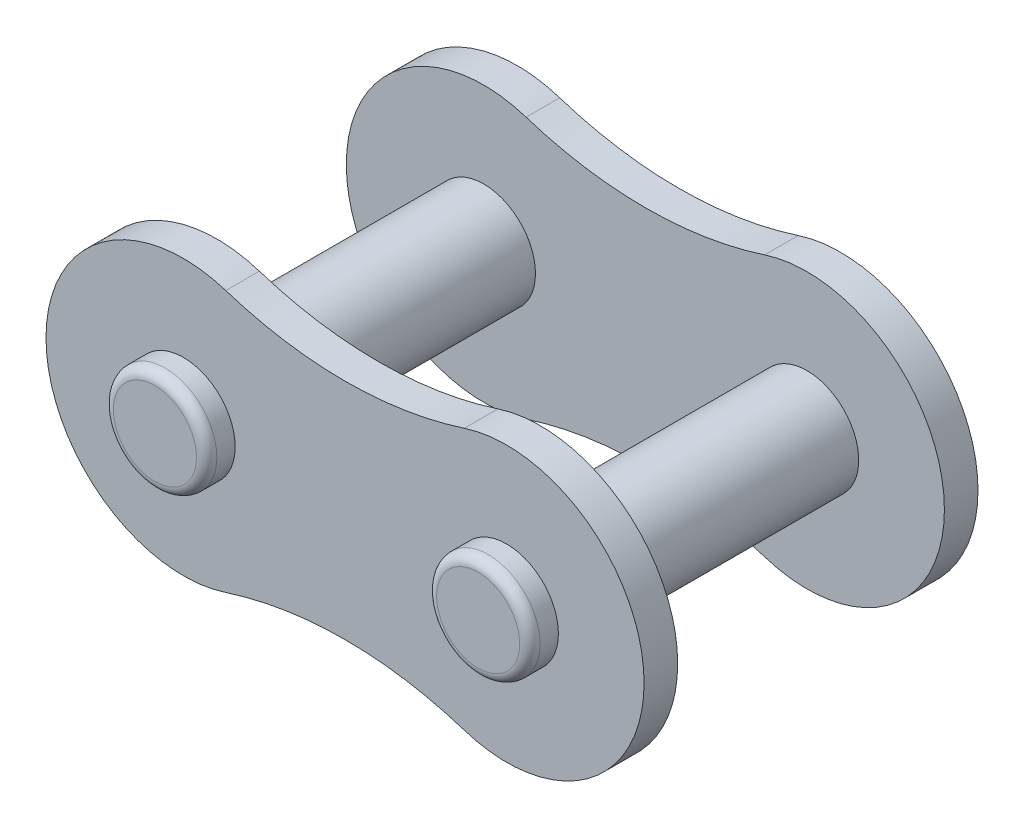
ISO-10303-21;
HEADER;
FILE_DESCRIPTION(('STEP AP214'),'2;1');
FILE_NAME('part.step','',(''),(''),'','','');
FILE_SCHEMA(('AUTOMOTIVE_DESIGN { 1 0 10303 214 1 1 1 1 }'));
ENDSEC;
DATA;
#1=APPLICATION_CONTEXT('core data for automotive mechanical design processes');
#2=APPLICATION_PROTOCOL_DEFINITION('international standard','automotive_design',2000,#1);
#3=PRODUCT_CONTEXT('',#1,'mechanical');
#4=PRODUCT('Part','Part','',(#3));
#5=PRODUCT_RELATED_PRODUCT_CATEGORY('part','',(#4));
#6=PRODUCT_DEFINITION_FORMATION('','',#4);
#7=PRODUCT_DEFINITION_CONTEXT('part definition',#1,'design');
#8=PRODUCT_DEFINITION('design','',#6,#7);
#9=PRODUCT_DEFINITION_SHAPE('','',#8);
#10=(LENGTH_UNIT() NAMED_UNIT(*) SI_UNIT(.MILLI.,.METRE.));
#11=(NAMED_UNIT(*) PLANE_ANGLE_UNIT() SI_UNIT($,.RADIAN.));
#12=(NAMED_UNIT(*) SI_UNIT($,.STERADIAN.) SOLID_ANGLE_UNIT());
#13=UNCERTAINTY_MEASURE_WITH_UNIT(LENGTH_MEASURE(1.E-05),#10,'distance_accuracy_value','');
#14=(GEOMETRIC_REPRESENTATION_CONTEXT(3) GLOBAL_UNCERTAINTY_ASSIGNED_CONTEXT((#13)) GLOBAL_UNIT_ASSIGNED_CONTEXT((#10,
#11,#12)) REPRESENTATION_CONTEXT('',''));
#15=CARTESIAN_POINT('',(0.,0.,0.));
#16=DIRECTION('',(0.,0.,1.));
#17=DIRECTION('',(1.,0.,0.));
#18=AXIS2_PLACEMENT_3D('',#15,#16,#17);
#19=CARTESIAN_POINT('',(0.,0.,-10.56));
#20=DIRECTION('',(0.,0.,-1.));
#21=DIRECTION('',(-1.,0.,0.));
#22=AXIS2_PLACEMENT_3D('',#19,#20,#21);
#23=CYLINDRICAL_SURFACE('',#22,2.54);
#24=CARTESIAN_POINT('',(0.,0.,-6.55));
#25=DIRECTION('',(0.,0.,-1.));
#26=DIRECTION('',(-1.,0.,0.));
#27=AXIS2_PLACEMENT_3D('',#24,#25,#26);
#28=CIRCLE('',#27,2.54);
#29=CARTESIAN_POINT('',(-2.54,0.,-6.55));
#30=VERTEX_POINT('',#29);
#31=EDGE_CURVE('E199',#30,#30,#28,.T.);
#32=ORIENTED_EDGE('',*,*,#31,.F.);
#33=EDGE_LOOP('',(#32));
#34=FACE_BOUND('',#33,.T.);
#35=CARTESIAN_POINT('',(0.,0.,6.55));
#36=DIRECTION('',(0.,0.,1.));
#37=DIRECTION('',(1.,0.,0.));
#38=AXIS2_PLACEMENT_3D('',#35,#36,#37);
#39=CIRCLE('',#38,2.54);
#40=CARTESIAN_POINT('',(2.54,0.,6.55));
#41=VERTEX_POINT('',#40);
#42=EDGE_CURVE('E11',#41,#41,#39,.T.);
#43=ORIENTED_EDGE('',*,*,#42,.F.);
#44=EDGE_LOOP('',(#43));
#45=FACE_BOUND('',#44,.T.);
#46=ADVANCED_FACE('F33',(#34,#45),#23,.T.);
#47=CARTESIAN_POINT('',(-15.875,0.,9.6));
#48=DIRECTION('',(0.,0.,1.));
#49=DIRECTION('',(1.,0.,0.));
#50=AXIS2_PLACEMENT_3D('',#47,#48,#49);
#51=CYLINDRICAL_SURFACE('',#50,2.54);
#52=CARTESIAN_POINT('',(-15.875,0.,-6.55));
#53=DIRECTION('',(0.,0.,-1.));
#54=DIRECTION('',(-1.,0.,0.));
#55=AXIS2_PLACEMENT_3D('',#52,#53,#54);
#56=CIRCLE('',#55,2.54);
#57=CARTESIAN_POINT('',(-18.415,0.,-6.55));
#58=VERTEX_POINT('',#57);
#59=EDGE_CURVE('E157',#58,#58,#56,.T.);
#60=ORIENTED_EDGE('',*,*,#59,.F.);
#61=EDGE_LOOP('',(#60));
#62=FACE_BOUND('',#61,.T.);
#63=CARTESIAN_POINT('',(-15.875,0.,6.55));
#64=DIRECTION('',(0.,0.,1.));
#65=DIRECTION('',(1.,0.,0.));
#66=AXIS2_PLACEMENT_3D('',#63,#64,#65);
#67=CIRCLE('',#66,2.54);
#68=CARTESIAN_POINT('',(-13.335,0.,6.55));
#69=VERTEX_POINT('',#68);
#70=EDGE_CURVE('E136',#69,#69,#67,.F.);
#71=ORIENTED_EDGE('',*,*,#70,.T.);
#72=EDGE_LOOP('',(#71));
#73=FACE_BOUND('',#72,.T.);
#74=ADVANCED_FACE('F204',(#62,#73),#51,.T.);
#75=CARTESIAN_POINT('',(0.,0.,-8.2));
#76=DIRECTION('',(0.,0.,-1.));
#77=DIRECTION('',(-1.,0.,0.));
#78=AXIS2_PLACEMENT_3D('',#75,#76,#77);
#79=CIRCLE('',#78,2.54);
#80=CARTESIAN_POINT('',(-2.54,0.,-8.2));
#81=VERTEX_POINT('',#80);
#82=EDGE_CURVE('E163',#81,#81,#79,.T.);
#83=ORIENTED_EDGE('',*,*,#82,.T.);
#84=EDGE_LOOP('',(#83));
#85=FACE_BOUND('',#84,.T.);
#86=CARTESIAN_POINT('',(0.,0.,-9.1));
#87=DIRECTION('',(0.,0.,-1.));
#88=DIRECTION('',(-1.,0.,0.));
#89=AXIS2_PLACEMENT_3D('',#86,#87,#88);
#90=CIRCLE('',#89,2.54);
#91=CARTESIAN_POINT('',(-2.54,0.,-9.1));
#92=VERTEX_POINT('',#91);
#93=EDGE_CURVE('E193',#92,#92,#90,.T.);
#94=ORIENTED_EDGE('',*,*,#93,.F.);
#95=EDGE_LOOP('',(#94));
#96=FACE_BOUND('',#95,.T.);
#97=ADVANCED_FACE('F214',(#85,#96),#23,.T.);
#98=CARTESIAN_POINT('',(0.,0.,-9.1));
#99=DIRECTION('',(0.,0.,-1.));
#100=DIRECTION('',(-1.,0.,0.));
#101=AXIS2_PLACEMENT_3D('',#98,#99,#100);
#102=TOROIDAL_SURFACE('',#101,2.04,0.500000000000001);
#103=CARTESIAN_POINT('',(0.,0.,-9.6));
#104=DIRECTION('',(0.,0.,-1.));
#105=DIRECTION('',(-1.,0.,0.));
#106=AXIS2_PLACEMENT_3D('',#103,#104,#105);
#107=CIRCLE('',#106,2.04);
#108=CARTESIAN_POINT('',(-2.04,0.,-9.6));
#109=VERTEX_POINT('',#108);
#110=EDGE_CURVE('E190',#109,#109,#107,.T.);
#111=ORIENTED_EDGE('',*,*,#110,.F.);
#112=EDGE_LOOP('',(#111));
#113=FACE_BOUND('',#112,.T.);
#114=ORIENTED_EDGE('',*,*,#93,.T.);
#115=EDGE_LOOP('',(#114));
#116=FACE_BOUND('',#115,.T.);
#117=ADVANCED_FACE('F227',(#113,#116),#102,.T.);
#118=CARTESIAN_POINT('',(0.,0.,-9.6));
#119=DIRECTION('',(0.,0.,1.));
#120=DIRECTION('',(1.,0.,0.));
#121=AXIS2_PLACEMENT_3D('',#118,#119,#120);
#122=PLANE('',#121);
#123=ORIENTED_EDGE('',*,*,#110,.T.);
#124=EDGE_LOOP('',(#123));
#125=FACE_BOUND('',#124,.T.);
#126=ADVANCED_FACE('F232',(#125),#122,.F.);
#127=CARTESIAN_POINT('',(-3.96875,-12.2480467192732,-8.2));
#128=DIRECTION('',(0.,0.,-1.));
#129=DIRECTION('',(-1.,0.,0.));
#130=AXIS2_PLACEMENT_3D('',#127,#128,#129);
#131=PLANE('',#130);
#132=ORIENTED_EDGE('',*,*,#82,.F.);
#133=EDGE_LOOP('',(#132));
#134=FACE_BOUND('',#133,.T.);
#135=CARTESIAN_POINT('',(-7.9375,-24.4960934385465,-8.2));
#136=DIRECTION('',(0.,0.,1.));
#137=DIRECTION('',(-1.,0.,0.));
#138=AXIS2_PLACEMENT_3D('',#135,#136,#137);
#139=CIRCLE('',#138,19.);
#140=CARTESIAN_POINT('',(-2.08070388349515,-6.42130604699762,-8.2));
#141=VERTEX_POINT('',#140);
#142=CARTESIAN_POINT('',(-13.7942961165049,-6.42130604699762,-8.2));
#143=VERTEX_POINT('',#142);
#144=EDGE_CURVE('E167',#141,#143,#139,.T.);
#145=ORIENTED_EDGE('',*,*,#144,.T.);
#146=CARTESIAN_POINT('',(-15.875,0.,-8.2));
#147=DIRECTION('',(0.,0.,-1.));
#148=DIRECTION('',(-1.,0.,0.));
#149=AXIS2_PLACEMENT_3D('',#146,#147,#148);
#150=CIRCLE('',#149,6.75);
#151=CARTESIAN_POINT('',(-13.7942961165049,6.42130604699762,-8.2));
#152=VERTEX_POINT('',#151);
#153=EDGE_CURVE('E83',#143,#152,#150,.T.);
#154=ORIENTED_EDGE('',*,*,#153,.T.);
#155=CARTESIAN_POINT('',(-7.9375,24.4960934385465,-8.2));
#156=DIRECTION('',(0.,0.,1.));
#157=DIRECTION('',(1.,0.,0.));
#158=AXIS2_PLACEMENT_3D('',#155,#156,#157);
#159=CIRCLE('',#158,19.);
#160=CARTESIAN_POINT('',(-2.08070388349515,6.42130604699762,-8.2));
#161=VERTEX_POINT('',#160);
#162=EDGE_CURVE('E170',#152,#161,#159,.T.);
#163=ORIENTED_EDGE('',*,*,#162,.T.);
#164=CARTESIAN_POINT('',(0.,0.,-8.2));
#165=DIRECTION('',(0.,0.,-1.));
#166=DIRECTION('',(-1.,0.,0.));
#167=AXIS2_PLACEMENT_3D('',#164,#165,#166);
#168=CIRCLE('',#167,6.75);
#169=EDGE_CURVE('E51',#161,#141,#168,.T.);
#170=ORIENTED_EDGE('',*,*,#169,.T.);
#171=EDGE_LOOP('',(#145,#154,#163,#170));
#172=FACE_BOUND('',#171,.T.);
#173=CARTESIAN_POINT('',(-15.875,0.,-8.2));
#174=DIRECTION('',(0.,0.,-1.));
#175=DIRECTION('',(-1.,0.,0.));
#176=AXIS2_PLACEMENT_3D('',#173,#174,#175);
#177=CIRCLE('',#176,2.54);
#178=CARTESIAN_POINT('',(-18.415,0.,-8.2));
#179=VERTEX_POINT('',#178);
#180=EDGE_CURVE('E160',#179,#179,#177,.T.);
#181=ORIENTED_EDGE('',*,*,#180,.F.);
#182=EDGE_LOOP('',(#181));
#183=FACE_BOUND('',#182,.T.);
#184=ADVANCED_FACE('F239',(#134,#172,#183),#131,.T.);
#185=CARTESIAN_POINT('',(-3.96875,-12.2480467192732,-6.55));
#186=DIRECTION('',(0.,0.,-1.));
#187=DIRECTION('',(-1.,0.,0.));
#188=AXIS2_PLACEMENT_3D('',#185,#186,#187);
#189=PLANE('',#188);
#190=CARTESIAN_POINT('',(-7.9375,-24.4960934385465,-6.55));
#191=DIRECTION('',(0.,0.,1.));
#192=DIRECTION('',(-1.,0.,0.));
#193=AXIS2_PLACEMENT_3D('',#190,#191,#192);
#194=CIRCLE('',#193,19.);
#195=CARTESIAN_POINT('',(-2.08070388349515,-6.42130604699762,-6.55));
#196=VERTEX_POINT('',#195);
#197=CARTESIAN_POINT('',(-13.7942961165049,-6.42130604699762,-6.55));
#198=VERTEX_POINT('',#197);
#199=EDGE_CURVE('E166',#196,#198,#194,.T.);
#200=ORIENTED_EDGE('',*,*,#199,.F.);
#201=CARTESIAN_POINT('',(0.,0.,-6.55));
#202=DIRECTION('',(0.,0.,-1.));
#203=DIRECTION('',(-1.,0.,0.));
#204=AXIS2_PLACEMENT_3D('',#201,#202,#203);
#205=CIRCLE('',#204,6.75);
#206=CARTESIAN_POINT('',(-2.08070388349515,6.42130604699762,-6.55));
#207=VERTEX_POINT('',#206);
#208=EDGE_CURVE('E75',#207,#196,#205,.T.);
#209=ORIENTED_EDGE('',*,*,#208,.F.);
#210=CARTESIAN_POINT('',(-7.9375,24.4960934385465,-6.55));
#211=DIRECTION('',(0.,0.,1.));
#212=DIRECTION('',(1.,0.,0.));
#213=AXIS2_PLACEMENT_3D('',#210,#211,#212);
#214=CIRCLE('',#213,19.);
#215=CARTESIAN_POINT('',(-13.7942961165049,6.42130604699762,-6.55));
#216=VERTEX_POINT('',#215);
#217=EDGE_CURVE('E69',#216,#207,#214,.T.);
#218=ORIENTED_EDGE('',*,*,#217,.F.);
#219=CARTESIAN_POINT('',(-15.875,0.,-6.55));
#220=DIRECTION('',(0.,0.,-1.));
#221=DIRECTION('',(-1.,0.,0.));
#222=AXIS2_PLACEMENT_3D('',#219,#220,#221);
#223=CIRCLE('',#222,6.75);
#224=EDGE_CURVE('E176',#198,#216,#223,.T.);
#225=ORIENTED_EDGE('',*,*,#224,.F.);
#226=EDGE_LOOP('',(#200,#209,#218,#225));
#227=FACE_BOUND('',#226,.T.);
#228=ORIENTED_EDGE('',*,*,#31,.T.);
#229=EDGE_LOOP('',(#228));
#230=FACE_BOUND('',#229,.T.);
#231=ORIENTED_EDGE('',*,*,#59,.T.);
#232=EDGE_LOOP('',(#231));
#233=FACE_BOUND('',#232,.T.);
#234=ADVANCED_FACE('F241',(#227,#230,#233),#189,.F.);
#235=CARTESIAN_POINT('',(-7.9375,-24.4960934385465,-8.2));
#236=DIRECTION('',(0.,0.,1.));
#237=DIRECTION('',(1.,0.,0.));
#238=AXIS2_PLACEMENT_3D('',#235,#236,#237);
#239=CYLINDRICAL_SURFACE('',#238,19.);
#240=ORIENTED_EDGE('',*,*,#199,.T.);
#241=DIRECTION('',(0.,0.,1.));
#242=VECTOR('',#241,1.);
#243=CARTESIAN_POINT('',(-13.7942961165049,-6.42130604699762,-8.2));
#244=LINE('',#243,#242);
#245=EDGE_CURVE('E185',#143,#198,#244,.T.);
#246=ORIENTED_EDGE('',*,*,#245,.F.);
#247=ORIENTED_EDGE('',*,*,#144,.F.);
#248=DIRECTION('',(0.,0.,1.));
#249=VECTOR('',#248,1.);
#250=CARTESIAN_POINT('',(-2.08070388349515,-6.42130604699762,-8.2));
#251=LINE('',#250,#249);
#252=EDGE_CURVE('E173',#141,#196,#251,.T.);
#253=ORIENTED_EDGE('',*,*,#252,.T.);
#254=EDGE_LOOP('',(#240,#246,#247,#253));
#255=FACE_BOUND('',#254,.T.);
#256=ADVANCED_FACE('F275',(#255),#239,.F.);
#257=CARTESIAN_POINT('',(-15.875,0.,-8.2));
#258=DIRECTION('',(0.,0.,1.));
#259=DIRECTION('',(1.,0.,0.));
#260=AXIS2_PLACEMENT_3D('',#257,#258,#259);
#261=CYLINDRICAL_SURFACE('',#260,6.75);
#262=ORIENTED_EDGE('',*,*,#224,.T.);
#263=DIRECTION('',(0.,0.,1.));
#264=VECTOR('',#263,1.);
#265=CARTESIAN_POINT('',(-13.7942961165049,6.42130604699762,-8.2));
#266=LINE('',#265,#264);
#267=EDGE_CURVE('E183',#152,#216,#266,.T.);
#268=ORIENTED_EDGE('',*,*,#267,.F.);
#269=ORIENTED_EDGE('',*,*,#153,.F.);
#270=ORIENTED_EDGE('',*,*,#245,.T.);
#271=EDGE_LOOP('',(#262,#268,#269,#270));
#272=FACE_BOUND('',#271,.T.);
#273=ADVANCED_FACE('F282',(#272),#261,.T.);
#274=CARTESIAN_POINT('',(-7.9375,24.4960934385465,-8.2));
#275=DIRECTION('',(0.,0.,1.));
#276=DIRECTION('',(1.,0.,0.));
#277=AXIS2_PLACEMENT_3D('',#274,#275,#276);
#278=CYLINDRICAL_SURFACE('',#277,19.);
#279=ORIENTED_EDGE('',*,*,#217,.T.);
#280=DIRECTION('',(0.,0.,1.));
#281=VECTOR('',#280,1.);
#282=CARTESIAN_POINT('',(-2.08070388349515,6.42130604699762,-8.2));
#283=LINE('',#282,#281);
#284=EDGE_CURVE('E181',#161,#207,#283,.T.);
#285=ORIENTED_EDGE('',*,*,#284,.F.);
#286=ORIENTED_EDGE('',*,*,#162,.F.);
#287=ORIENTED_EDGE('',*,*,#267,.T.);
#288=EDGE_LOOP('',(#279,#285,#286,#287));
#289=FACE_BOUND('',#288,.T.);
#290=ADVANCED_FACE('F279',(#289),#278,.F.);
#291=CARTESIAN_POINT('',(0.,0.,-8.2));
#292=DIRECTION('',(0.,0.,1.));
#293=DIRECTION('',(1.,0.,0.));
#294=AXIS2_PLACEMENT_3D('',#291,#292,#293);
#295=CYLINDRICAL_SURFACE('',#294,6.75);
#296=ORIENTED_EDGE('',*,*,#208,.T.);
#297=ORIENTED_EDGE('',*,*,#252,.F.);
#298=ORIENTED_EDGE('',*,*,#169,.F.);
#299=ORIENTED_EDGE('',*,*,#284,.T.);
#300=EDGE_LOOP('',(#296,#297,#298,#299));
#301=FACE_BOUND('',#300,.T.);
#302=ADVANCED_FACE('F260',(#301),#295,.T.);
#303=CARTESIAN_POINT('',(-17.915,0.,-9.6));
#304=DIRECTION('',(0.,0.,-1.));
#305=DIRECTION('',(-1.,0.,0.));
#306=AXIS2_PLACEMENT_3D('',#303,#304,#305);
#307=PLANE('',#306);
#308=CARTESIAN_POINT('',(-15.875,0.,-9.6));
#309=DIRECTION('',(0.,0.,1.));
#310=DIRECTION('',(1.,0.,0.));
#311=AXIS2_PLACEMENT_3D('',#308,#309,#310);
#312=CIRCLE('',#311,2.04);
#313=CARTESIAN_POINT('',(-13.835,0.,-9.6));
#314=VERTEX_POINT('',#313);
#315=EDGE_CURVE('E151',#314,#314,#312,.T.);
#316=ORIENTED_EDGE('',*,*,#315,.F.);
#317=EDGE_LOOP('',(#316));
#318=FACE_BOUND('',#317,.T.);
#319=ADVANCED_FACE('F254',(#318),#307,.T.);
#320=CARTESIAN_POINT('',(-15.875,0.,-9.1));
#321=DIRECTION('',(0.,0.,1.));
#322=DIRECTION('',(1.,0.,0.));
#323=AXIS2_PLACEMENT_3D('',#320,#321,#322);
#324=TOROIDAL_SURFACE('',#323,2.04,0.500000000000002);
#325=ORIENTED_EDGE('',*,*,#315,.T.);
#326=EDGE_LOOP('',(#325));
#327=FACE_BOUND('',#326,.T.);
#328=CARTESIAN_POINT('',(-15.875,0.,-9.1));
#329=DIRECTION('',(0.,0.,1.));
#330=DIRECTION('',(1.,0.,0.));
#331=AXIS2_PLACEMENT_3D('',#328,#329,#330);
#332=CIRCLE('',#331,2.54);
#333=CARTESIAN_POINT('',(-13.335,0.,-9.1));
#334=VERTEX_POINT('',#333);
#335=EDGE_CURVE('E148',#334,#334,#332,.T.);
#336=ORIENTED_EDGE('',*,*,#335,.F.);
#337=EDGE_LOOP('',(#336));
#338=FACE_BOUND('',#337,.T.);
#339=ADVANCED_FACE('F250',(#327,#338),#324,.T.);
#340=ORIENTED_EDGE('',*,*,#180,.T.);
#341=EDGE_LOOP('',(#340));
#342=FACE_BOUND('',#341,.T.);
#343=ORIENTED_EDGE('',*,*,#335,.T.);
#344=EDGE_LOOP('',(#343));
#345=FACE_BOUND('',#344,.T.);
#346=ADVANCED_FACE('F221',(#342,#345),#51,.T.);
#347=CARTESIAN_POINT('',(-3.96875,-12.2480467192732,8.2));
#348=DIRECTION('',(0.,0.,1.));
#349=DIRECTION('',(-1.,0.,0.));
#350=AXIS2_PLACEMENT_3D('',#347,#348,#349);
#351=PLANE('',#350);
#352=CARTESIAN_POINT('',(-15.875,0.,8.2));
#353=DIRECTION('',(0.,0.,1.));
#354=DIRECTION('',(1.,0.,0.));
#355=AXIS2_PLACEMENT_3D('',#352,#353,#354);
#356=CIRCLE('',#355,2.54);
#357=CARTESIAN_POINT('',(-13.335,0.,8.2));
#358=VERTEX_POINT('',#357);
#359=EDGE_CURVE('E37',#358,#358,#356,.F.);
#360=ORIENTED_EDGE('',*,*,#359,.T.);
#361=EDGE_LOOP('',(#360));
#362=FACE_BOUND('',#361,.T.);
#363=CARTESIAN_POINT('',(-7.9375,-24.4960934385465,8.2));
#364=DIRECTION('',(0.,0.,1.));
#365=DIRECTION('',(-1.,0.,0.));
#366=AXIS2_PLACEMENT_3D('',#363,#364,#365);
#367=CIRCLE('',#366,19.);
#368=CARTESIAN_POINT('',(-2.08070388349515,-6.42130604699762,8.2));
#369=VERTEX_POINT('',#368);
#370=CARTESIAN_POINT('',(-13.7942961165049,-6.42130604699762,8.2));
#371=VERTEX_POINT('',#370);
#372=EDGE_CURVE('E134',#369,#371,#367,.T.);
#373=ORIENTED_EDGE('',*,*,#372,.F.);
#374=CARTESIAN_POINT('',(0.,0.,8.2));
#375=DIRECTION('',(0.,0.,-1.));
#376=DIRECTION('',(-1.,0.,0.));
#377=AXIS2_PLACEMENT_3D('',#374,#375,#376);
#378=CIRCLE('',#377,6.75);
#379=CARTESIAN_POINT('',(-2.08070388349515,6.42130604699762,8.2));
#380=VERTEX_POINT('',#379);
#381=EDGE_CURVE('E116',#380,#369,#378,.T.);
#382=ORIENTED_EDGE('',*,*,#381,.F.);
#383=CARTESIAN_POINT('',(-7.9375,24.4960934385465,8.2));
#384=DIRECTION('',(0.,0.,1.));
#385=DIRECTION('',(1.,0.,0.));
#386=AXIS2_PLACEMENT_3D('',#383,#384,#385);
#387=CIRCLE('',#386,19.);
#388=CARTESIAN_POINT('',(-13.7942961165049,6.42130604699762,8.2));
#389=VERTEX_POINT('',#388);
#390=EDGE_CURVE('E468',#389,#380,#387,.T.);
#391=ORIENTED_EDGE('',*,*,#390,.F.);
#392=CARTESIAN_POINT('',(-15.875,0.,8.2));
#393=DIRECTION('',(0.,0.,-1.));
#394=DIRECTION('',(-1.,0.,0.));
#395=AXIS2_PLACEMENT_3D('',#392,#393,#394);
#396=CIRCLE('',#395,6.75);
#397=EDGE_CURVE('E138',#371,#389,#396,.T.);
#398=ORIENTED_EDGE('',*,*,#397,.F.);
#399=EDGE_LOOP('',(#373,#382,#391,#398));
#400=FACE_BOUND('',#399,.T.);
#401=CARTESIAN_POINT('',(0.,0.,8.2));
#402=DIRECTION('',(0.,0.,1.));
#403=DIRECTION('',(1.,0.,0.));
#404=AXIS2_PLACEMENT_3D('',#401,#402,#403);
#405=CIRCLE('',#404,2.54);
#406=CARTESIAN_POINT('',(2.54,0.,8.2));
#407=VERTEX_POINT('',#406);
#408=EDGE_CURVE('E142',#407,#407,#405,.T.);
#409=ORIENTED_EDGE('',*,*,#408,.F.);
#410=EDGE_LOOP('',(#409));
#411=FACE_BOUND('',#410,.T.);
#412=ADVANCED_FACE('F207',(#362,#400,#411),#351,.T.);
#413=CARTESIAN_POINT('',(-3.96875,-12.2480467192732,6.55));
#414=DIRECTION('',(0.,0.,1.));
#415=DIRECTION('',(-1.,0.,0.));
#416=AXIS2_PLACEMENT_3D('',#413,#414,#415);
#417=PLANE('',#416);
#418=CARTESIAN_POINT('',(-7.9375,-24.4960934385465,6.55));
#419=DIRECTION('',(0.,0.,1.));
#420=DIRECTION('',(-1.,0.,0.));
#421=AXIS2_PLACEMENT_3D('',#418,#419,#420);
#422=CIRCLE('',#421,19.);
#423=CARTESIAN_POINT('',(-2.08070388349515,-6.42130604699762,6.55));
#424=VERTEX_POINT('',#423);
#425=CARTESIAN_POINT('',(-13.7942961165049,-6.42130604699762,6.55));
#426=VERTEX_POINT('',#425);
#427=EDGE_CURVE('E127',#424,#426,#422,.T.);
#428=ORIENTED_EDGE('',*,*,#427,.T.);
#429=CARTESIAN_POINT('',(-15.875,0.,6.55));
#430=DIRECTION('',(0.,0.,-1.));
#431=DIRECTION('',(-1.,0.,0.));
#432=AXIS2_PLACEMENT_3D('',#429,#430,#431);
#433=CIRCLE('',#432,6.75);
#434=CARTESIAN_POINT('',(-13.7942961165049,6.42130604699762,6.55));
#435=VERTEX_POINT('',#434);
#436=EDGE_CURVE('E469',#426,#435,#433,.T.);
#437=ORIENTED_EDGE('',*,*,#436,.T.);
#438=CARTESIAN_POINT('',(-7.9375,24.4960934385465,6.55));
#439=DIRECTION('',(0.,0.,1.));
#440=DIRECTION('',(1.,0.,0.));
#441=AXIS2_PLACEMENT_3D('',#438,#439,#440);
#442=CIRCLE('',#441,19.);
#443=CARTESIAN_POINT('',(-2.08070388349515,6.42130604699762,6.55));
#444=VERTEX_POINT('',#443);
#445=EDGE_CURVE('E129',#435,#444,#442,.T.);
#446=ORIENTED_EDGE('',*,*,#445,.T.);
#447=CARTESIAN_POINT('',(0.,0.,6.55));
#448=DIRECTION('',(0.,0.,-1.));
#449=DIRECTION('',(-1.,0.,0.));
#450=AXIS2_PLACEMENT_3D('',#447,#448,#449);
#451=CIRCLE('',#450,6.75);
#452=EDGE_CURVE('E113',#444,#424,#451,.T.);
#453=ORIENTED_EDGE('',*,*,#452,.T.);
#454=EDGE_LOOP('',(#428,#437,#446,#453));
#455=FACE_BOUND('',#454,.T.);
#456=ORIENTED_EDGE('',*,*,#70,.F.);
#457=EDGE_LOOP('',(#456));
#458=FACE_BOUND('',#457,.T.);
#459=ORIENTED_EDGE('',*,*,#42,.T.);
#460=EDGE_LOOP('',(#459));
#461=FACE_BOUND('',#460,.T.);
#462=ADVANCED_FACE('F124',(#455,#458,#461),#417,.F.);
#463=CARTESIAN_POINT('',(-7.9375,-24.4960934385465,8.2));
#464=DIRECTION('',(0.,0.,-1.));
#465=DIRECTION('',(1.,0.,0.));
#466=AXIS2_PLACEMENT_3D('',#463,#464,#465);
#467=CYLINDRICAL_SURFACE('',#466,19.);
#468=ORIENTED_EDGE('',*,*,#427,.F.);
#469=DIRECTION('',(0.,0.,-1.));
#470=VECTOR('',#469,1.);
#471=CARTESIAN_POINT('',(-2.08070388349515,-6.42130604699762,8.2));
#472=LINE('',#471,#470);
#473=EDGE_CURVE('E110',#369,#424,#472,.T.);
#474=ORIENTED_EDGE('',*,*,#473,.F.);
#475=ORIENTED_EDGE('',*,*,#372,.T.);
#476=DIRECTION('',(0.,0.,-1.));
#477=VECTOR('',#476,1.);
#478=CARTESIAN_POINT('',(-13.7942961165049,-6.42130604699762,8.2));
#479=LINE('',#478,#477);
#480=EDGE_CURVE('E132',#371,#426,#479,.T.);
#481=ORIENTED_EDGE('',*,*,#480,.T.);
#482=EDGE_LOOP('',(#468,#474,#475,#481));
#483=FACE_BOUND('',#482,.T.);
#484=ADVANCED_FACE('F131',(#483),#467,.F.);
#485=CARTESIAN_POINT('',(-15.875,0.,8.2));
#486=DIRECTION('',(0.,0.,-1.));
#487=DIRECTION('',(1.,0.,0.));
#488=AXIS2_PLACEMENT_3D('',#485,#486,#487);
#489=CYLINDRICAL_SURFACE('',#488,6.75);
#490=ORIENTED_EDGE('',*,*,#436,.F.);
#491=ORIENTED_EDGE('',*,*,#480,.F.);
#492=ORIENTED_EDGE('',*,*,#397,.T.);
#493=DIRECTION('',(0.,0.,-1.));
#494=VECTOR('',#493,1.);
#495=CARTESIAN_POINT('',(-13.7942961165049,6.42130604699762,8.2));
#496=LINE('',#495,#494);
#497=EDGE_CURVE('E470',#389,#435,#496,.T.);
#498=ORIENTED_EDGE('',*,*,#497,.T.);
#499=EDGE_LOOP('',(#490,#491,#492,#498));
#500=FACE_BOUND('',#499,.T.);
#501=ADVANCED_FACE('F376',(#500),#489,.T.);
#502=CARTESIAN_POINT('',(-7.9375,24.4960934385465,8.2));
#503=DIRECTION('',(0.,0.,-1.));
#504=DIRECTION('',(1.,0.,0.));
#505=AXIS2_PLACEMENT_3D('',#502,#503,#504);
#506=CYLINDRICAL_SURFACE('',#505,19.);
#507=ORIENTED_EDGE('',*,*,#445,.F.);
#508=ORIENTED_EDGE('',*,*,#497,.F.);
#509=ORIENTED_EDGE('',*,*,#390,.T.);
#510=DIRECTION('',(0.,0.,-1.));
#511=VECTOR('',#510,1.);
#512=CARTESIAN_POINT('',(-2.08070388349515,6.42130604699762,8.2));
#513=LINE('',#512,#511);
#514=EDGE_CURVE('E476',#380,#444,#513,.T.);
#515=ORIENTED_EDGE('',*,*,#514,.T.);
#516=EDGE_LOOP('',(#507,#508,#509,#515));
#517=FACE_BOUND('',#516,.T.);
#518=ADVANCED_FACE('F385',(#517),#506,.F.);
#519=CARTESIAN_POINT('',(0.,0.,8.2));
#520=DIRECTION('',(0.,0.,-1.));
#521=DIRECTION('',(1.,0.,0.));
#522=AXIS2_PLACEMENT_3D('',#519,#520,#521);
#523=CYLINDRICAL_SURFACE('',#522,6.75);
#524=ORIENTED_EDGE('',*,*,#452,.F.);
#525=ORIENTED_EDGE('',*,*,#514,.F.);
#526=ORIENTED_EDGE('',*,*,#381,.T.);
#527=ORIENTED_EDGE('',*,*,#473,.T.);
#528=EDGE_LOOP('',(#524,#525,#526,#527));
#529=FACE_BOUND('',#528,.T.);
#530=ADVANCED_FACE('F112',(#529),#523,.T.);
#531=CARTESIAN_POINT('',(-15.875,0.,9.6));
#532=DIRECTION('',(0.,0.,1.));
#533=DIRECTION('',(1.,0.,0.));
#534=AXIS2_PLACEMENT_3D('',#531,#532,#533);
#535=PLANE('',#534);
#536=CARTESIAN_POINT('',(-15.875,0.,9.6));
#537=DIRECTION('',(0.,0.,1.));
#538=DIRECTION('',(1.,0.,0.));
#539=AXIS2_PLACEMENT_3D('',#536,#537,#538);
#540=CIRCLE('',#539,2.04);
#541=CARTESIAN_POINT('',(-13.835,0.,9.6));
#542=VERTEX_POINT('',#541);
#543=EDGE_CURVE('E154',#542,#542,#540,.T.);
#544=ORIENTED_EDGE('',*,*,#543,.T.);
#545=EDGE_LOOP('',(#544));
#546=FACE_BOUND('',#545,.T.);
#547=ADVANCED_FACE('F265',(#546),#535,.T.);
#548=CARTESIAN_POINT('',(-15.875,0.,9.1));
#549=DIRECTION('',(0.,0.,1.));
#550=DIRECTION('',(1.,0.,0.));
#551=AXIS2_PLACEMENT_3D('',#548,#549,#550);
#552=TOROIDAL_SURFACE('',#551,2.04,0.5);
#553=CARTESIAN_POINT('',(-15.875,0.,9.1));
#554=DIRECTION('',(0.,0.,1.));
#555=DIRECTION('',(1.,0.,0.));
#556=AXIS2_PLACEMENT_3D('',#553,#554,#555);
#557=CIRCLE('',#556,2.54);
#558=CARTESIAN_POINT('',(-13.335,0.,9.1));
#559=VERTEX_POINT('',#558);
#560=EDGE_CURVE('E145',#559,#559,#557,.T.);
#561=ORIENTED_EDGE('',*,*,#560,.T.);
#562=EDGE_LOOP('',(#561));
#563=FACE_BOUND('',#562,.T.);
#564=ORIENTED_EDGE('',*,*,#543,.F.);
#565=EDGE_LOOP('',(#564));
#566=FACE_BOUND('',#565,.T.);
#567=ADVANCED_FACE('F268',(#563,#566),#552,.T.);
#568=ORIENTED_EDGE('',*,*,#359,.F.);
#569=EDGE_LOOP('',(#568));
#570=FACE_BOUND('',#569,.T.);
#571=ORIENTED_EDGE('',*,*,#560,.F.);
#572=EDGE_LOOP('',(#571));
#573=FACE_BOUND('',#572,.T.);
#574=ADVANCED_FACE('F220',(#570,#573),#51,.T.);
#575=CARTESIAN_POINT('',(2.04,0.,9.6));
#576=DIRECTION('',(0.,0.,-1.));
#577=DIRECTION('',(-1.,0.,0.));
#578=AXIS2_PLACEMENT_3D('',#575,#576,#577);
#579=PLANE('',#578);
#580=CARTESIAN_POINT('',(0.,0.,9.6));
#581=DIRECTION('',(0.,0.,-1.));
#582=DIRECTION('',(-1.,0.,0.));
#583=AXIS2_PLACEMENT_3D('',#580,#581,#582);
#584=CIRCLE('',#583,2.04);
#585=CARTESIAN_POINT('',(-2.04,0.,9.6));
#586=VERTEX_POINT('',#585);
#587=EDGE_CURVE('E187',#586,#586,#584,.T.);
#588=ORIENTED_EDGE('',*,*,#587,.F.);
#589=EDGE_LOOP('',(#588));
#590=FACE_BOUND('',#589,.T.);
#591=ADVANCED_FACE('F288',(#590),#579,.F.);
#592=CARTESIAN_POINT('',(0.,0.,9.1));
#593=DIRECTION('',(0.,0.,-1.));
#594=DIRECTION('',(-1.,0.,0.));
#595=AXIS2_PLACEMENT_3D('',#592,#593,#594);
#596=TOROIDAL_SURFACE('',#595,2.04,0.5);
#597=CARTESIAN_POINT('',(0.,0.,9.1));
#598=DIRECTION('',(0.,0.,-1.));
#599=DIRECTION('',(-1.,0.,0.));
#600=AXIS2_PLACEMENT_3D('',#597,#598,#599);
#601=CIRCLE('',#600,2.54);
#602=CARTESIAN_POINT('',(-2.54,0.,9.1));
#603=VERTEX_POINT('',#602);
#604=EDGE_CURVE('E196',#603,#603,#601,.T.);
#605=ORIENTED_EDGE('',*,*,#604,.F.);
#606=EDGE_LOOP('',(#605));
#607=FACE_BOUND('',#606,.T.);
#608=ORIENTED_EDGE('',*,*,#587,.T.);
#609=EDGE_LOOP('',(#608));
#610=FACE_BOUND('',#609,.T.);
#611=ADVANCED_FACE('F35',(#607,#610),#596,.T.);
#612=ORIENTED_EDGE('',*,*,#408,.T.);
#613=EDGE_LOOP('',(#612));
#614=FACE_BOUND('',#613,.T.);
#615=ORIENTED_EDGE('',*,*,#604,.T.);
#616=EDGE_LOOP('',(#615));
#617=FACE_BOUND('',#616,.T.);
#618=ADVANCED_FACE('F213',(#614,#617),#23,.T.);
#619=CLOSED_SHELL('',(#46,#74,#97,#117,#126,#184,#234,#256,#273,#290,#302,#319,#339,#346,#412,
#462,#484,#501,#518,#530,#547,#567,#574,#591,#611,#618));
#620=MANIFOLD_SOLID_BREP('B2',#619);
#621=ADVANCED_BREP_SHAPE_REPRESENTATION('',(#18,#620),#14);
#622=SHAPE_DEFINITION_REPRESENTATION(#9,#621);
ENDSEC;
END-ISO-10303-21;
